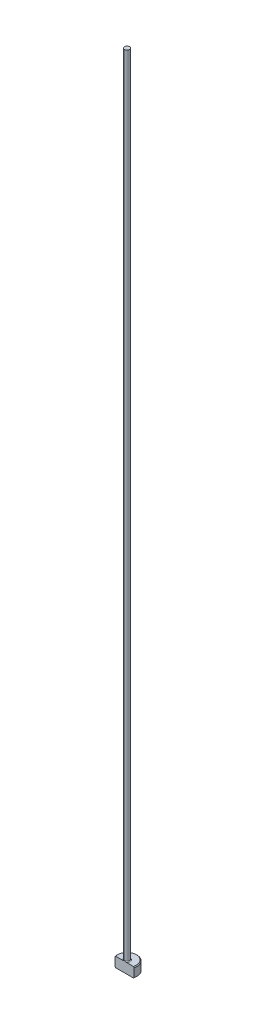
from build123d import *

# Parameters (mm, degrees)
CHAMFER1_SIZE = 0.254
FILLET1_R     = 0.254
KEY_DEPTH     = 255.0396844


with BuildPart() as part:
    # Sketch1 → Revolve1 (revolve)
    with BuildSketch(Plane.XY, mode=Mode.PRIVATE) as revolve1_sk:
        Polygon((0, 0), (-3.175, 0), (-3.175, 3.175), (-0.79375, 3.175), (-0.79375, 254), (0, 254), align=None)
    revolve(revolve1_sk.sketch.rotate(Axis((0, 259.958771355, 0), (0, -1, 0)), 270), axis=Axis((0, 259.958771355, 0), (0, -1, 0)))

    # Chamfer1
    chamfer1_edges = [part.edges().sort_by_distance(p)[0] for p in [
        (0, 3.175, -3.175),
        (0, 0, -3.175),
    ]]
    chamfer(chamfer1_edges, length=CHAMFER1_SIZE)

    # Fillet1
    fillet1_edges = [part.edges().sort_by_distance(p)[0] for p in [
        (0, 3.175, -0.79375),
    ]]
    fillet(fillet1_edges, radius=FILLET1_R)

    # Sketch2 → Key (cut, through all)
    with BuildSketch(Plane(origin=(0, 0, 0), x_dir=(1, 0, 0), z_dir=(0, 1, 0))):
        with BuildLine():
            Line((-3.074180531, -0.79375), (3.074180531, -0.79375))
            ThreePointArc((3.074180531, -0.79375), (0, -3.175), (-3.074180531, -0.79375))
        make_face()
    extrude(amount=KEY_DEPTH, mode=Mode.SUBTRACT)


solid = part.part
